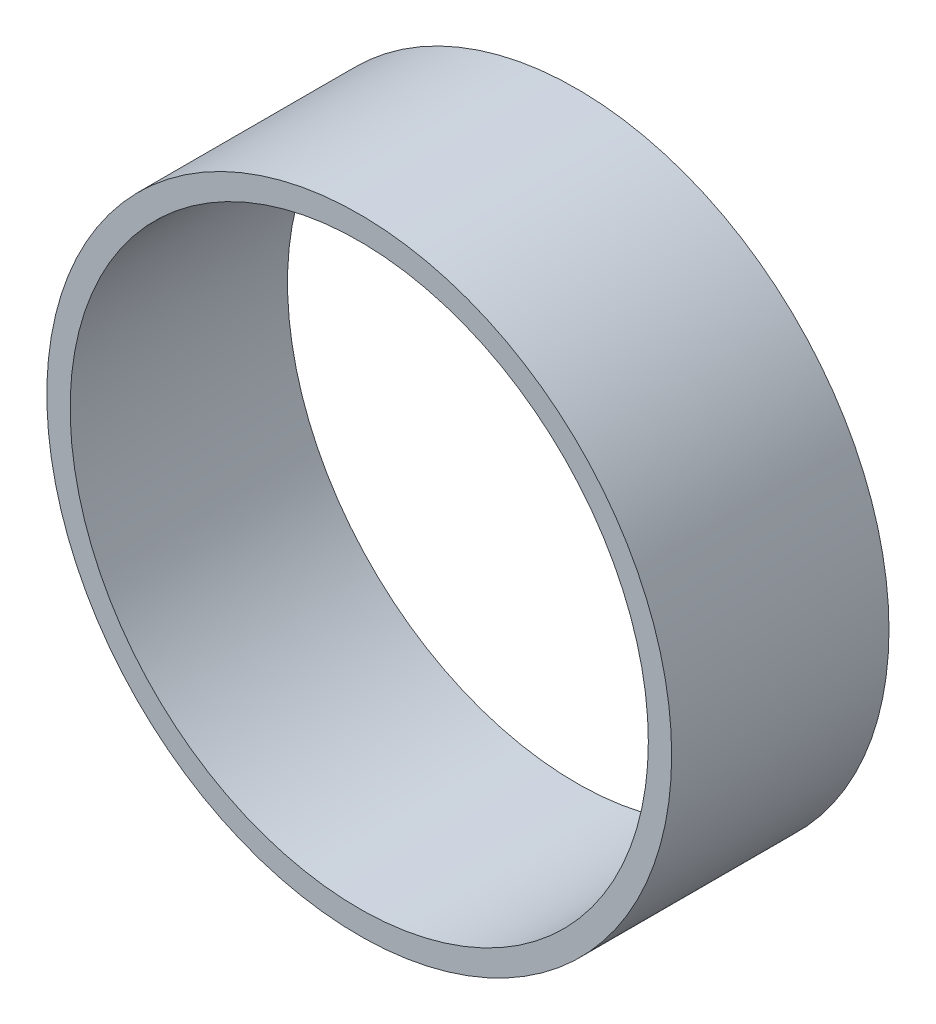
ISO-10303-21;
HEADER;
FILE_DESCRIPTION(('STEP AP214'),'2;1');
FILE_NAME('part.step','',(''),(''),'','','');
FILE_SCHEMA(('AUTOMOTIVE_DESIGN { 1 0 10303 214 1 1 1 1 }'));
ENDSEC;
DATA;
#1=APPLICATION_CONTEXT('core data for automotive mechanical design processes');
#2=APPLICATION_PROTOCOL_DEFINITION('international standard','automotive_design',2000,#1);
#3=PRODUCT_CONTEXT('',#1,'mechanical');
#4=PRODUCT('Part','Part','',(#3));
#5=PRODUCT_RELATED_PRODUCT_CATEGORY('part','',(#4));
#6=PRODUCT_DEFINITION_FORMATION('','',#4);
#7=PRODUCT_DEFINITION_CONTEXT('part definition',#1,'design');
#8=PRODUCT_DEFINITION('design','',#6,#7);
#9=PRODUCT_DEFINITION_SHAPE('','',#8);
#10=(LENGTH_UNIT() NAMED_UNIT(*) SI_UNIT(.MILLI.,.METRE.));
#11=(NAMED_UNIT(*) PLANE_ANGLE_UNIT() SI_UNIT($,.RADIAN.));
#12=(NAMED_UNIT(*) SI_UNIT($,.STERADIAN.) SOLID_ANGLE_UNIT());
#13=UNCERTAINTY_MEASURE_WITH_UNIT(LENGTH_MEASURE(1.E-05),#10,'distance_accuracy_value','');
#14=(GEOMETRIC_REPRESENTATION_CONTEXT(3) GLOBAL_UNCERTAINTY_ASSIGNED_CONTEXT((#13)) GLOBAL_UNIT_ASSIGNED_CONTEXT((#10,
#11,#12)) REPRESENTATION_CONTEXT('',''));
#15=CARTESIAN_POINT('',(0.,0.,0.));
#16=DIRECTION('',(0.,0.,1.));
#17=DIRECTION('',(1.,0.,0.));
#18=AXIS2_PLACEMENT_3D('',#15,#16,#17);
#19=CARTESIAN_POINT('',(0.,0.,38.1));
#20=DIRECTION('',(0.,0.,1.00000000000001));
#21=DIRECTION('',(1.00000000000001,0.,0.));
#22=AXIS2_PLACEMENT_3D('',#19,#20,#21);
#23=PLANE('',#22);
#24=CARTESIAN_POINT('',(0.,0.,38.1));
#25=DIRECTION('',(0.,0.,1.00000000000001));
#26=DIRECTION('',(1.00000000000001,0.,0.));
#27=AXIS2_PLACEMENT_3D('',#24,#25,#26);
#28=CIRCLE('',#27,109.5375);
#29=CARTESIAN_POINT('',(109.537500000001,0.,38.1000000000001));
#30=VERTEX_POINT('',#29);
#31=EDGE_CURVE('E10',#30,#30,#28,.T.);
#32=ORIENTED_EDGE('',*,*,#31,.T.);
#33=EDGE_LOOP('',(#32));
#34=FACE_BOUND('',#33,.T.);
#35=CARTESIAN_POINT('',(0.,0.,38.1));
#36=DIRECTION('',(0.,0.,1.00000000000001));
#37=DIRECTION('',(1.00000000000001,0.,0.));
#38=AXIS2_PLACEMENT_3D('',#35,#36,#37);
#39=CIRCLE('',#38,101.3587);
#40=CARTESIAN_POINT('',(101.358700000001,0.,38.1000000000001));
#41=VERTEX_POINT('',#40);
#42=EDGE_CURVE('E41',#41,#41,#39,.T.);
#43=ORIENTED_EDGE('',*,*,#42,.F.);
#44=EDGE_LOOP('',(#43));
#45=FACE_BOUND('',#44,.T.);
#46=ADVANCED_FACE('F30',(#34,#45),#23,.T.);
#47=CARTESIAN_POINT('',(1.99840144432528E-12,0.,-38.1));
#48=DIRECTION('',(0.,0.,1.00000000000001));
#49=DIRECTION('',(1.00000000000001,0.,0.));
#50=AXIS2_PLACEMENT_3D('',#47,#48,#49);
#51=PLANE('',#50);
#52=CARTESIAN_POINT('',(1.99840144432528E-12,0.,-38.1));
#53=DIRECTION('',(0.,0.,1.00000000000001));
#54=DIRECTION('',(1.00000000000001,0.,0.));
#55=AXIS2_PLACEMENT_3D('',#52,#53,#54);
#56=CIRCLE('',#55,109.5375);
#57=CARTESIAN_POINT('',(109.537500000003,0.,-38.1));
#58=VERTEX_POINT('',#57);
#59=EDGE_CURVE('E34',#58,#58,#56,.T.);
#60=ORIENTED_EDGE('',*,*,#59,.F.);
#61=EDGE_LOOP('',(#60));
#62=FACE_BOUND('',#61,.T.);
#63=CARTESIAN_POINT('',(1.99840144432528E-12,0.,-38.1));
#64=DIRECTION('',(0.,0.,1.00000000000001));
#65=DIRECTION('',(1.00000000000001,0.,0.));
#66=AXIS2_PLACEMENT_3D('',#63,#64,#65);
#67=CIRCLE('',#66,101.3587);
#68=CARTESIAN_POINT('',(101.358700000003,0.,-38.1));
#69=VERTEX_POINT('',#68);
#70=EDGE_CURVE('E43',#69,#69,#67,.T.);
#71=ORIENTED_EDGE('',*,*,#70,.T.);
#72=EDGE_LOOP('',(#71));
#73=FACE_BOUND('',#72,.T.);
#74=ADVANCED_FACE('F53',(#62,#73),#51,.F.);
#75=CARTESIAN_POINT('',(0.,0.,38.1));
#76=DIRECTION('',(0.,0.,-1.00000000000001));
#77=DIRECTION('',(-1.00000000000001,0.,0.));
#78=AXIS2_PLACEMENT_3D('',#75,#76,#77);
#79=CYLINDRICAL_SURFACE('',#78,109.5375);
#80=ORIENTED_EDGE('',*,*,#31,.F.);
#81=EDGE_LOOP('',(#80));
#82=FACE_BOUND('',#81,.T.);
#83=ORIENTED_EDGE('',*,*,#59,.T.);
#84=EDGE_LOOP('',(#83));
#85=FACE_BOUND('',#84,.T.);
#86=ADVANCED_FACE('F32',(#82,#85),#79,.T.);
#87=CARTESIAN_POINT('',(0.,0.,38.1));
#88=DIRECTION('',(0.,0.,-1.00000000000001));
#89=DIRECTION('',(-1.00000000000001,0.,0.));
#90=AXIS2_PLACEMENT_3D('',#87,#88,#89);
#91=CYLINDRICAL_SURFACE('',#90,101.3587);
#92=ORIENTED_EDGE('',*,*,#42,.T.);
#93=EDGE_LOOP('',(#92));
#94=FACE_BOUND('',#93,.T.);
#95=ORIENTED_EDGE('',*,*,#70,.F.);
#96=EDGE_LOOP('',(#95));
#97=FACE_BOUND('',#96,.T.);
#98=ADVANCED_FACE('F49',(#94,#97),#91,.F.);
#99=CLOSED_SHELL('',(#46,#74,#86,#98));
#100=MANIFOLD_SOLID_BREP('B2',#99);
#101=ADVANCED_BREP_SHAPE_REPRESENTATION('',(#18,#100),#14);
#102=SHAPE_DEFINITION_REPRESENTATION(#9,#101);
ENDSEC;
END-ISO-10303-21;
